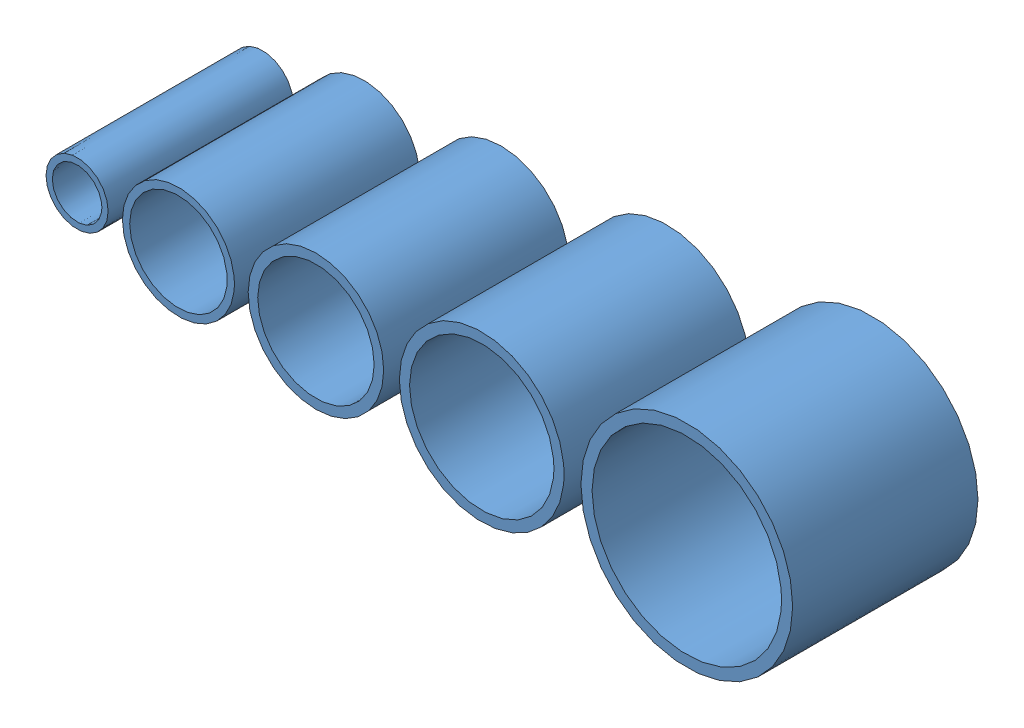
SolidWorks assembly Compare_Pipes.SLDASM, configuration Default (file format 13000). Lengths in mm.
Overall size (402.96 114.3 100).
5 component instances, 1 part files, 0 mates.
Components (placement in the parent):
- pipe-1: pipe.SLDPRT [Pipe 1 in, Sch 40] at origin size (33.53 33.53 100)
- pipe-2: pipe.SLDPRT [Pipe 2 in, Sch 40] at (54.701 0 0) size (60.45 60.45 100)
- pipe-3: pipe.SLDPRT [Pipe 2.5 in, Sch 40] at (128.9068 0 0) size (73.15 73.15 100)
- pipe-4: pipe.SLDPRT [Pipe 3 in, Sch 40] at (218.3774 0 0) size (88.9 88.9 100)
- pipe-5: pipe.SLDPRT [Pipe 4 in, Sch 40] at (329.049 0 0) size (114.3 114.3 100)
